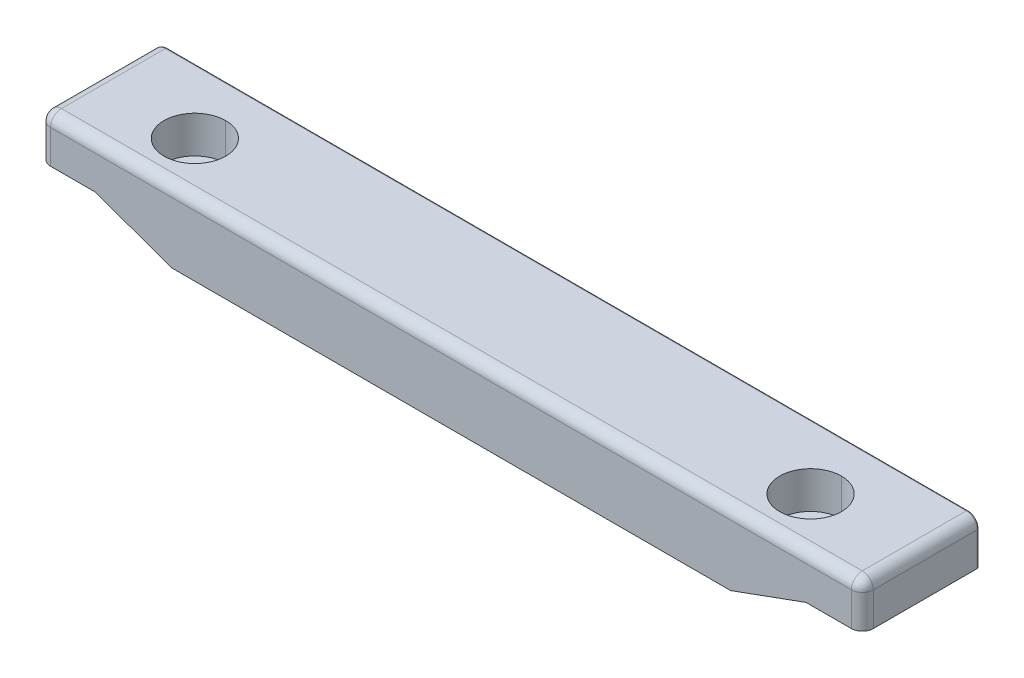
ISO-10303-21;
HEADER;
FILE_DESCRIPTION(('STEP AP214'),'2;1');
FILE_NAME('part.step','',(''),(''),'','','');
FILE_SCHEMA(('AUTOMOTIVE_DESIGN { 1 0 10303 214 1 1 1 1 }'));
ENDSEC;
DATA;
#1=APPLICATION_CONTEXT('core data for automotive mechanical design processes');
#2=APPLICATION_PROTOCOL_DEFINITION('international standard','automotive_design',2000,#1);
#3=PRODUCT_CONTEXT('',#1,'mechanical');
#4=PRODUCT('Part','Part','',(#3));
#5=PRODUCT_RELATED_PRODUCT_CATEGORY('part','',(#4));
#6=PRODUCT_DEFINITION_FORMATION('','',#4);
#7=PRODUCT_DEFINITION_CONTEXT('part definition',#1,'design');
#8=PRODUCT_DEFINITION('design','',#6,#7);
#9=PRODUCT_DEFINITION_SHAPE('','',#8);
#10=(LENGTH_UNIT() NAMED_UNIT(*) SI_UNIT(.MILLI.,.METRE.));
#11=(NAMED_UNIT(*) PLANE_ANGLE_UNIT() SI_UNIT($,.RADIAN.));
#12=(NAMED_UNIT(*) SI_UNIT($,.STERADIAN.) SOLID_ANGLE_UNIT());
#13=UNCERTAINTY_MEASURE_WITH_UNIT(LENGTH_MEASURE(1.E-05),#10,'distance_accuracy_value','');
#14=(GEOMETRIC_REPRESENTATION_CONTEXT(3) GLOBAL_UNCERTAINTY_ASSIGNED_CONTEXT((#13)) GLOBAL_UNIT_ASSIGNED_CONTEXT((#10,
#11,#12)) REPRESENTATION_CONTEXT('',''));
#15=CARTESIAN_POINT('',(0.,0.,0.));
#16=DIRECTION('',(0.,0.,1.));
#17=DIRECTION('',(1.,0.,0.));
#18=AXIS2_PLACEMENT_3D('',#15,#16,#17);
#19=CARTESIAN_POINT('',(-44.9,29.,0.975));
#20=DIRECTION('',(0.,1.,0.));
#21=DIRECTION('',(0.,0.,1.));
#22=AXIS2_PLACEMENT_3D('',#19,#20,#21);
#23=CYLINDRICAL_SURFACE('',#22,4.5);
#24=DIRECTION('',(0.,1.,0.));
#25=VECTOR('',#24,1.);
#26=CARTESIAN_POINT('',(-44.9,29.,-3.525));
#27=LINE('',#26,#25);
#28=CARTESIAN_POINT('',(-44.9,23.6,-3.525));
#29=VERTEX_POINT('',#28);
#30=CARTESIAN_POINT('',(-44.9,29.,-3.525));
#31=VERTEX_POINT('',#30);
#32=EDGE_CURVE('E277',#29,#31,#27,.T.);
#33=ORIENTED_EDGE('',*,*,#32,.F.);
#34=CARTESIAN_POINT('',(-44.9,23.6,0.975));
#35=DIRECTION('',(0.,1.,0.));
#36=DIRECTION('',(0.,0.,1.));
#37=AXIS2_PLACEMENT_3D('',#34,#35,#36);
#38=CIRCLE('',#37,4.5);
#39=CARTESIAN_POINT('',(-44.9,23.6,5.475));
#40=VERTEX_POINT('',#39);
#41=EDGE_CURVE('E10',#40,#29,#38,.T.);
#42=ORIENTED_EDGE('',*,*,#41,.F.);
#43=DIRECTION('',(0.,1.,0.));
#44=VECTOR('',#43,1.);
#45=CARTESIAN_POINT('',(-44.9,29.,5.475));
#46=LINE('',#45,#44);
#47=CARTESIAN_POINT('',(-44.9,29.,5.475));
#48=VERTEX_POINT('',#47);
#49=EDGE_CURVE('E306',#40,#48,#46,.T.);
#50=ORIENTED_EDGE('',*,*,#49,.T.);
#51=CARTESIAN_POINT('',(-44.9,29.,0.975));
#52=DIRECTION('',(0.,1.,0.));
#53=DIRECTION('',(0.,0.,1.));
#54=AXIS2_PLACEMENT_3D('',#51,#52,#53);
#55=CIRCLE('',#54,4.5);
#56=EDGE_CURVE('E396',#48,#31,#55,.T.);
#57=ORIENTED_EDGE('',*,*,#56,.T.);
#58=EDGE_LOOP('',(#33,#42,#50,#57));
#59=FACE_BOUND('',#58,.T.);
#60=ADVANCED_FACE('F15',(#59),#23,.F.);
#61=CARTESIAN_POINT('',(-42.15,23.6,0.975));
#62=DIRECTION('',(0.,-1.,0.));
#63=DIRECTION('',(0.,0.,-1.));
#64=AXIS2_PLACEMENT_3D('',#61,#62,#63);
#65=PLANE('',#64);
#66=CARTESIAN_POINT('',(-44.9,23.6,0.975));
#67=DIRECTION('',(0.,1.,0.));
#68=DIRECTION('',(0.,0.,1.));
#69=AXIS2_PLACEMENT_3D('',#66,#67,#68);
#70=CIRCLE('',#69,2.75);
#71=CARTESIAN_POINT('',(-44.9,23.6,3.725));
#72=VERTEX_POINT('',#71);
#73=CARTESIAN_POINT('',(-44.9,23.6,-1.775));
#74=VERTEX_POINT('',#73);
#75=EDGE_CURVE('E24',#72,#74,#70,.T.);
#76=ORIENTED_EDGE('',*,*,#75,.F.);
#77=CARTESIAN_POINT('',(-44.9,23.6,0.975));
#78=DIRECTION('',(0.,1.,0.));
#79=DIRECTION('',(0.,0.,1.));
#80=AXIS2_PLACEMENT_3D('',#77,#78,#79);
#81=CIRCLE('',#80,2.75);
#82=EDGE_CURVE('E338',#74,#72,#81,.T.);
#83=ORIENTED_EDGE('',*,*,#82,.F.);
#84=EDGE_LOOP('',(#76,#83));
#85=FACE_BOUND('',#84,.T.);
#86=ORIENTED_EDGE('',*,*,#41,.T.);
#87=CARTESIAN_POINT('',(-44.9,23.6,0.975));
#88=DIRECTION('',(0.,1.,0.));
#89=DIRECTION('',(0.,0.,1.));
#90=AXIS2_PLACEMENT_3D('',#87,#88,#89);
#91=CIRCLE('',#90,4.5);
#92=EDGE_CURVE('E274',#29,#40,#91,.T.);
#93=ORIENTED_EDGE('',*,*,#92,.T.);
#94=EDGE_LOOP('',(#86,#93));
#95=FACE_BOUND('',#94,.T.);
#96=ADVANCED_FACE('F597',(#85,#95),#65,.F.);
#97=CARTESIAN_POINT('',(-44.9,29.,0.975));
#98=DIRECTION('',(0.,1.,0.));
#99=DIRECTION('',(0.,0.,1.));
#100=AXIS2_PLACEMENT_3D('',#97,#98,#99);
#101=CYLINDRICAL_SURFACE('',#100,2.75);
#102=DIRECTION('',(0.,1.,0.));
#103=VECTOR('',#102,1.);
#104=CARTESIAN_POINT('',(-44.9,29.,-1.775));
#105=LINE('',#104,#103);
#106=CARTESIAN_POINT('',(-44.9,19.9975988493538,-1.775));
#107=VERTEX_POINT('',#106);
#108=EDGE_CURVE('E332',#107,#74,#105,.T.);
#109=ORIENTED_EDGE('',*,*,#108,.F.);
#110=CARTESIAN_POINT('',(-44.9,19.9975988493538,3.725));
#111=CARTESIAN_POINT('',(-39.3999999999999,17.9957625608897,3.725));
#112=CARTESIAN_POINT('',(-39.3999999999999,17.9957625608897,-1.77499999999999));
#113=CARTESIAN_POINT('',(-44.9,19.9975988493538,-1.775));
#114=(BOUNDED_CURVE() B_SPLINE_CURVE(3,(#110,#111,#112,#113),.UNSPECIFIED.,.F.,
.F.) B_SPLINE_CURVE_WITH_KNOTS((4,4),(1.5707963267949,4.71238898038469),
.UNSPECIFIED.) CURVE() GEOMETRIC_REPRESENTATION_ITEM() RATIONAL_B_SPLINE_CURVE((1.,
0.333333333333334,0.333333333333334,1.)) REPRESENTATION_ITEM(''));
#115=CARTESIAN_POINT('',(-44.9,19.9975988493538,3.725));
#116=VERTEX_POINT('',#115);
#117=EDGE_CURVE('E420',#116,#107,#114,.T.);
#118=ORIENTED_EDGE('',*,*,#117,.F.);
#119=DIRECTION('',(0.,1.,0.));
#120=VECTOR('',#119,1.);
#121=CARTESIAN_POINT('',(-44.9,29.,3.725));
#122=LINE('',#121,#120);
#123=EDGE_CURVE('E349',#116,#72,#122,.T.);
#124=ORIENTED_EDGE('',*,*,#123,.T.);
#125=ORIENTED_EDGE('',*,*,#75,.T.);
#126=EDGE_LOOP('',(#109,#118,#124,#125));
#127=FACE_BOUND('',#126,.T.);
#128=ADVANCED_FACE('F602',(#127),#101,.F.);
#129=CARTESIAN_POINT('',(44.9,29.,0.974999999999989));
#130=DIRECTION('',(0.,1.,0.));
#131=DIRECTION('',(0.,0.,1.));
#132=AXIS2_PLACEMENT_3D('',#129,#130,#131);
#133=CYLINDRICAL_SURFACE('',#132,4.5);
#134=DIRECTION('',(0.,1.,0.));
#135=VECTOR('',#134,1.);
#136=CARTESIAN_POINT('',(44.9,29.,-3.525));
#137=LINE('',#136,#135);
#138=CARTESIAN_POINT('',(44.9,23.6,-3.525));
#139=VERTEX_POINT('',#138);
#140=CARTESIAN_POINT('',(44.9,29.,-3.525));
#141=VERTEX_POINT('',#140);
#142=EDGE_CURVE('E288',#139,#141,#137,.T.);
#143=ORIENTED_EDGE('',*,*,#142,.F.);
#144=CARTESIAN_POINT('',(44.9,23.6,0.974999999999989));
#145=DIRECTION('',(0.,1.,0.));
#146=DIRECTION('',(0.,0.,1.));
#147=AXIS2_PLACEMENT_3D('',#144,#145,#146);
#148=CIRCLE('',#147,4.5);
#149=CARTESIAN_POINT('',(44.9,23.6,5.475));
#150=VERTEX_POINT('',#149);
#151=EDGE_CURVE('E448',#150,#139,#148,.T.);
#152=ORIENTED_EDGE('',*,*,#151,.F.);
#153=DIRECTION('',(0.,1.,0.));
#154=VECTOR('',#153,1.);
#155=CARTESIAN_POINT('',(44.9,29.,5.475));
#156=LINE('',#155,#154);
#157=CARTESIAN_POINT('',(44.9,29.,5.475));
#158=VERTEX_POINT('',#157);
#159=EDGE_CURVE('E313',#150,#158,#156,.T.);
#160=ORIENTED_EDGE('',*,*,#159,.T.);
#161=CARTESIAN_POINT('',(44.9,29.,0.974999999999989));
#162=DIRECTION('',(0.,1.,0.));
#163=DIRECTION('',(0.,0.,1.));
#164=AXIS2_PLACEMENT_3D('',#161,#162,#163);
#165=CIRCLE('',#164,4.5);
#166=EDGE_CURVE('E399',#158,#141,#165,.T.);
#167=ORIENTED_EDGE('',*,*,#166,.T.);
#168=EDGE_LOOP('',(#143,#152,#160,#167));
#169=FACE_BOUND('',#168,.T.);
#170=ADVANCED_FACE('F647',(#169),#133,.F.);
#171=CARTESIAN_POINT('',(47.65,23.6,0.974999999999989));
#172=DIRECTION('',(0.,-1.,0.));
#173=DIRECTION('',(0.,0.,-1.));
#174=AXIS2_PLACEMENT_3D('',#171,#172,#173);
#175=PLANE('',#174);
#176=CARTESIAN_POINT('',(44.9,23.6,0.974999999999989));
#177=DIRECTION('',(0.,1.,0.));
#178=DIRECTION('',(0.,0.,1.));
#179=AXIS2_PLACEMENT_3D('',#176,#177,#178);
#180=CIRCLE('',#179,2.75);
#181=CARTESIAN_POINT('',(44.9,23.6,3.725));
#182=VERTEX_POINT('',#181);
#183=CARTESIAN_POINT('',(44.9,23.6,-1.775));
#184=VERTEX_POINT('',#183);
#185=EDGE_CURVE('E18',#182,#184,#180,.T.);
#186=ORIENTED_EDGE('',*,*,#185,.F.);
#187=CARTESIAN_POINT('',(44.9,23.6,0.974999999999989));
#188=DIRECTION('',(0.,1.,0.));
#189=DIRECTION('',(0.,0.,1.));
#190=AXIS2_PLACEMENT_3D('',#187,#188,#189);
#191=CIRCLE('',#190,2.75);
#192=EDGE_CURVE('E343',#184,#182,#191,.T.);
#193=ORIENTED_EDGE('',*,*,#192,.F.);
#194=EDGE_LOOP('',(#186,#193));
#195=FACE_BOUND('',#194,.T.);
#196=ORIENTED_EDGE('',*,*,#151,.T.);
#197=CARTESIAN_POINT('',(44.9,23.6,0.974999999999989));
#198=DIRECTION('',(0.,1.,0.));
#199=DIRECTION('',(0.,0.,1.));
#200=AXIS2_PLACEMENT_3D('',#197,#198,#199);
#201=CIRCLE('',#200,4.5);
#202=EDGE_CURVE('E293',#139,#150,#201,.T.);
#203=ORIENTED_EDGE('',*,*,#202,.T.);
#204=EDGE_LOOP('',(#196,#203));
#205=FACE_BOUND('',#204,.T.);
#206=ADVANCED_FACE('F530',(#195,#205),#175,.F.);
#207=CARTESIAN_POINT('',(44.9,29.,0.974999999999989));
#208=DIRECTION('',(0.,1.,0.));
#209=DIRECTION('',(0.,0.,1.));
#210=AXIS2_PLACEMENT_3D('',#207,#208,#209);
#211=CYLINDRICAL_SURFACE('',#210,2.75);
#212=DIRECTION('',(0.,1.,0.));
#213=VECTOR('',#212,1.);
#214=CARTESIAN_POINT('',(44.9,29.,-1.775));
#215=LINE('',#214,#213);
#216=CARTESIAN_POINT('',(44.9,19.9975988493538,-1.775));
#217=VERTEX_POINT('',#216);
#218=EDGE_CURVE('E340',#217,#184,#215,.T.);
#219=ORIENTED_EDGE('',*,*,#218,.F.);
#220=CARTESIAN_POINT('',(44.9,19.9975988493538,3.725));
#221=CARTESIAN_POINT('',(50.4,21.9994351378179,3.72499999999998));
#222=CARTESIAN_POINT('',(50.4,21.9994351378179,-1.77500000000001));
#223=CARTESIAN_POINT('',(44.9,19.9975988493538,-1.775));
#224=(BOUNDED_CURVE() B_SPLINE_CURVE(3,(#220,#221,#222,#223),.UNSPECIFIED.,.F.,
.F.) B_SPLINE_CURVE_WITH_KNOTS((4,4),(4.71238898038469,7.85398163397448),
.UNSPECIFIED.) CURVE() GEOMETRIC_REPRESENTATION_ITEM() RATIONAL_B_SPLINE_CURVE((1.,
0.333333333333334,0.333333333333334,1.)) REPRESENTATION_ITEM(''));
#225=CARTESIAN_POINT('',(44.9,19.9975988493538,3.725));
#226=VERTEX_POINT('',#225);
#227=EDGE_CURVE('E419',#226,#217,#224,.T.);
#228=ORIENTED_EDGE('',*,*,#227,.F.);
#229=DIRECTION('',(0.,1.,0.));
#230=VECTOR('',#229,1.);
#231=CARTESIAN_POINT('',(44.9,29.,3.725));
#232=LINE('',#231,#230);
#233=EDGE_CURVE('E359',#226,#182,#232,.T.);
#234=ORIENTED_EDGE('',*,*,#233,.T.);
#235=ORIENTED_EDGE('',*,*,#185,.T.);
#236=EDGE_LOOP('',(#219,#228,#234,#235));
#237=FACE_BOUND('',#236,.T.);
#238=ADVANCED_FACE('F526',(#237),#211,.F.);
#239=CARTESIAN_POINT('',(51.7882898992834,22.5047313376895,-128.591982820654));
#240=DIRECTION('',(-0.342020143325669,0.939692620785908,0.));
#241=DIRECTION('',(0.,0.,1.));
#242=AXIS2_PLACEMENT_3D('',#239,#240,#241);
#243=PLANE('',#242);
#244=ORIENTED_EDGE('',*,*,#227,.T.);
#245=CARTESIAN_POINT('',(44.9,19.9975988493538,-1.775));
#246=CARTESIAN_POINT('',(39.4,17.9957625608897,-1.77500000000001));
#247=CARTESIAN_POINT('',(39.4,17.9957625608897,3.72499999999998));
#248=CARTESIAN_POINT('',(44.9,19.9975988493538,3.725));
#249=(BOUNDED_CURVE() B_SPLINE_CURVE(3,(#245,#246,#247,#248),.UNSPECIFIED.,.F.,
.F.) B_SPLINE_CURVE_WITH_KNOTS((4,4),(1.5707963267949,4.71238898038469),
.UNSPECIFIED.) CURVE() GEOMETRIC_REPRESENTATION_ITEM() RATIONAL_B_SPLINE_CURVE((1.,
0.333333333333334,0.333333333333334,1.)) REPRESENTATION_ITEM(''));
#250=EDGE_CURVE('E344',#217,#226,#249,.T.);
#251=ORIENTED_EDGE('',*,*,#250,.T.);
#252=EDGE_LOOP('',(#244,#251));
#253=FACE_BOUND('',#252,.T.);
#254=DIRECTION('',(0.939692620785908,0.342020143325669,0.));
#255=VECTOR('',#254,1.);
#256=CARTESIAN_POINT('',(51.7882898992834,22.5047313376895,-8.525));
#257=LINE('',#256,#255);
#258=CARTESIAN_POINT('',(40.7991183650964,18.505,-8.525));
#259=VERTEX_POINT('',#258);
#260=CARTESIAN_POINT('',(51.7891183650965,22.5050328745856,-8.525));
#261=VERTEX_POINT('',#260);
#262=EDGE_CURVE('E462',#259,#261,#257,.T.);
#263=ORIENTED_EDGE('',*,*,#262,.T.);
#264=DIRECTION('',(0.,0.,1.));
#265=VECTOR('',#264,1.);
#266=CARTESIAN_POINT('',(51.7891183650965,22.5050328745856,-128.591982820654));
#267=LINE('',#266,#265);
#268=CARTESIAN_POINT('',(51.7891183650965,22.5050328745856,8.525));
#269=VERTEX_POINT('',#268);
#270=EDGE_CURVE('E498',#261,#269,#267,.T.);
#271=ORIENTED_EDGE('',*,*,#270,.T.);
#272=DIRECTION('',(-0.939692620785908,-0.342020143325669,0.));
#273=VECTOR('',#272,1.);
#274=CARTESIAN_POINT('',(51.7882898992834,22.5047313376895,8.525));
#275=LINE('',#274,#273);
#276=CARTESIAN_POINT('',(40.7991183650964,18.505,8.525));
#277=VERTEX_POINT('',#276);
#278=EDGE_CURVE('E298',#269,#277,#275,.T.);
#279=ORIENTED_EDGE('',*,*,#278,.T.);
#280=DIRECTION('',(0.,0.,1.));
#281=VECTOR('',#280,1.);
#282=CARTESIAN_POINT('',(40.7991183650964,18.505,-128.591982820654));
#283=LINE('',#282,#281);
#284=EDGE_CURVE('E36',#259,#277,#283,.T.);
#285=ORIENTED_EDGE('',*,*,#284,.F.);
#286=EDGE_LOOP('',(#263,#271,#279,#285));
#287=FACE_BOUND('',#286,.T.);
#288=ADVANCED_FACE('F534',(#253,#287),#243,.F.);
#289=CARTESIAN_POINT('',(-40.8,18.505,-128.591982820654));
#290=DIRECTION('',(0.,1.,0.));
#291=DIRECTION('',(1.,0.,0.));
#292=AXIS2_PLACEMENT_3D('',#289,#290,#291);
#293=PLANE('',#292);
#294=DIRECTION('',(1.,0.,0.));
#295=VECTOR('',#294,1.);
#296=CARTESIAN_POINT('',(-40.8,18.505,-8.525));
#297=LINE('',#296,#295);
#298=CARTESIAN_POINT('',(-40.7991183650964,18.505,-8.525));
#299=VERTEX_POINT('',#298);
#300=EDGE_CURVE('E466',#299,#259,#297,.T.);
#301=ORIENTED_EDGE('',*,*,#300,.T.);
#302=ORIENTED_EDGE('',*,*,#284,.T.);
#303=DIRECTION('',(-1.,0.,0.));
#304=VECTOR('',#303,1.);
#305=CARTESIAN_POINT('',(-40.8,18.505,8.525));
#306=LINE('',#305,#304);
#307=CARTESIAN_POINT('',(-40.7991183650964,18.505,8.525));
#308=VERTEX_POINT('',#307);
#309=EDGE_CURVE('E325',#277,#308,#306,.T.);
#310=ORIENTED_EDGE('',*,*,#309,.T.);
#311=DIRECTION('',(0.,0.,1.));
#312=VECTOR('',#311,1.);
#313=CARTESIAN_POINT('',(-40.7991183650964,18.505,-128.591982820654));
#314=LINE('',#313,#312);
#315=EDGE_CURVE('E46',#299,#308,#314,.T.);
#316=ORIENTED_EDGE('',*,*,#315,.F.);
#317=EDGE_LOOP('',(#301,#302,#310,#316));
#318=FACE_BOUND('',#317,.T.);
#319=ADVANCED_FACE('F537',(#318),#293,.F.);
#320=CARTESIAN_POINT('',(-51.7882898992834,22.5047313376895,-128.591982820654));
#321=DIRECTION('',(0.342020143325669,0.939692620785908,0.));
#322=DIRECTION('',(0.,0.,-1.));
#323=AXIS2_PLACEMENT_3D('',#320,#321,#322);
#324=PLANE('',#323);
#325=ORIENTED_EDGE('',*,*,#117,.T.);
#326=CARTESIAN_POINT('',(-44.9,19.9975988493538,-1.775));
#327=CARTESIAN_POINT('',(-50.4,21.9994351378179,-1.775));
#328=CARTESIAN_POINT('',(-50.4,21.9994351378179,3.72499999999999));
#329=CARTESIAN_POINT('',(-44.9,19.9975988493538,3.725));
#330=(BOUNDED_CURVE() B_SPLINE_CURVE(3,(#326,#327,#328,#329),.UNSPECIFIED.,.F.,
.F.) B_SPLINE_CURVE_WITH_KNOTS((4,4),(4.71238898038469,7.85398163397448),
.UNSPECIFIED.) CURVE() GEOMETRIC_REPRESENTATION_ITEM() RATIONAL_B_SPLINE_CURVE((1.,
0.333333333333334,0.333333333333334,1.)) REPRESENTATION_ITEM(''));
#331=EDGE_CURVE('E321',#107,#116,#330,.T.);
#332=ORIENTED_EDGE('',*,*,#331,.T.);
#333=EDGE_LOOP('',(#325,#332));
#334=FACE_BOUND('',#333,.T.);
#335=DIRECTION('',(0.939692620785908,-0.342020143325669,0.));
#336=VECTOR('',#335,1.);
#337=CARTESIAN_POINT('',(-51.7882898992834,22.5047313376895,-8.525));
#338=LINE('',#337,#336);
#339=CARTESIAN_POINT('',(-51.7891183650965,22.5050328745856,-8.525));
#340=VERTEX_POINT('',#339);
#341=EDGE_CURVE('E469',#340,#299,#338,.T.);
#342=ORIENTED_EDGE('',*,*,#341,.T.);
#343=ORIENTED_EDGE('',*,*,#315,.T.);
#344=DIRECTION('',(-0.939692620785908,0.342020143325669,0.));
#345=VECTOR('',#344,1.);
#346=CARTESIAN_POINT('',(-51.7882898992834,22.5047313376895,8.525));
#347=LINE('',#346,#345);
#348=CARTESIAN_POINT('',(-51.7891183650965,22.5050328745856,8.525));
#349=VERTEX_POINT('',#348);
#350=EDGE_CURVE('E322',#308,#349,#347,.T.);
#351=ORIENTED_EDGE('',*,*,#350,.T.);
#352=DIRECTION('',(0.,0.,1.));
#353=VECTOR('',#352,1.);
#354=CARTESIAN_POINT('',(-51.7891183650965,22.5050328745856,-128.591982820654));
#355=LINE('',#354,#353);
#356=EDGE_CURVE('E501',#340,#349,#355,.T.);
#357=ORIENTED_EDGE('',*,*,#356,.F.);
#358=EDGE_LOOP('',(#342,#343,#351,#357));
#359=FACE_BOUND('',#358,.T.);
#360=ADVANCED_FACE('F585',(#334,#359),#324,.F.);
#361=CARTESIAN_POINT('',(-60.,22.5050328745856,-128.591982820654));
#362=DIRECTION('',(0.,1.,0.));
#363=DIRECTION('',(1.,0.,0.));
#364=AXIS2_PLACEMENT_3D('',#361,#362,#363);
#365=PLANE('',#364);
#366=CARTESIAN_POINT('',(-58.4,22.5050328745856,6.925));
#367=DIRECTION('',(0.,-1.,0.));
#368=DIRECTION('',(0.,0.,1.));
#369=AXIS2_PLACEMENT_3D('',#366,#367,#368);
#370=CIRCLE('',#369,1.6);
#371=CARTESIAN_POINT('',(-58.4,22.5050328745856,8.525));
#372=VERTEX_POINT('',#371);
#373=CARTESIAN_POINT('',(-60.,22.5050328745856,6.925));
#374=VERTEX_POINT('',#373);
#375=EDGE_CURVE('E231',#372,#374,#370,.T.);
#376=ORIENTED_EDGE('',*,*,#375,.T.);
#377=DIRECTION('',(0.,0.,1.));
#378=VECTOR('',#377,1.);
#379=CARTESIAN_POINT('',(-60.,22.5050328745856,-128.591982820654));
#380=LINE('',#379,#378);
#381=CARTESIAN_POINT('',(-60.,22.5050328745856,-8.225));
#382=VERTEX_POINT('',#381);
#383=EDGE_CURVE('E297',#382,#374,#380,.T.);
#384=ORIENTED_EDGE('',*,*,#383,.F.);
#385=CARTESIAN_POINT('',(-59.7,22.5050328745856,-8.225));
#386=DIRECTION('',(0.,-1.,0.));
#387=DIRECTION('',(0.,0.,1.));
#388=AXIS2_PLACEMENT_3D('',#385,#386,#387);
#389=CIRCLE('',#388,0.3);
#390=CARTESIAN_POINT('',(-59.7,22.5050328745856,-8.525));
#391=VERTEX_POINT('',#390);
#392=EDGE_CURVE('E309',#382,#391,#389,.T.);
#393=ORIENTED_EDGE('',*,*,#392,.T.);
#394=DIRECTION('',(1.,0.,0.));
#395=VECTOR('',#394,1.);
#396=CARTESIAN_POINT('',(-60.,22.5050328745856,-8.525));
#397=LINE('',#396,#395);
#398=EDGE_CURVE('E472',#391,#340,#397,.T.);
#399=ORIENTED_EDGE('',*,*,#398,.T.);
#400=ORIENTED_EDGE('',*,*,#356,.T.);
#401=DIRECTION('',(-1.,0.,0.));
#402=VECTOR('',#401,1.);
#403=CARTESIAN_POINT('',(-60.,22.5050328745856,8.525));
#404=LINE('',#403,#402);
#405=EDGE_CURVE('E326',#349,#372,#404,.T.);
#406=ORIENTED_EDGE('',*,*,#405,.T.);
#407=EDGE_LOOP('',(#376,#384,#393,#399,#400,#406));
#408=FACE_BOUND('',#407,.T.);
#409=ADVANCED_FACE('F583',(#408),#365,.F.);
#410=CARTESIAN_POINT('',(60.,22.5050328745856,-128.591982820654));
#411=DIRECTION('',(0.,1.,0.));
#412=DIRECTION('',(1.,0.,0.));
#413=AXIS2_PLACEMENT_3D('',#410,#411,#412);
#414=PLANE('',#413);
#415=CARTESIAN_POINT('',(58.4,22.5050328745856,6.925));
#416=DIRECTION('',(0.,-1.,0.));
#417=DIRECTION('',(0.,0.,1.));
#418=AXIS2_PLACEMENT_3D('',#415,#416,#417);
#419=CIRCLE('',#418,1.6);
#420=CARTESIAN_POINT('',(60.,22.5050328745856,6.925));
#421=VERTEX_POINT('',#420);
#422=CARTESIAN_POINT('',(58.4,22.5050328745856,8.525));
#423=VERTEX_POINT('',#422);
#424=EDGE_CURVE('E480',#421,#423,#419,.T.);
#425=ORIENTED_EDGE('',*,*,#424,.T.);
#426=DIRECTION('',(-1.,0.,0.));
#427=VECTOR('',#426,1.);
#428=CARTESIAN_POINT('',(60.,22.5050328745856,8.525));
#429=LINE('',#428,#427);
#430=EDGE_CURVE('E426',#423,#269,#429,.T.);
#431=ORIENTED_EDGE('',*,*,#430,.T.);
#432=ORIENTED_EDGE('',*,*,#270,.F.);
#433=DIRECTION('',(1.,0.,0.));
#434=VECTOR('',#433,1.);
#435=CARTESIAN_POINT('',(60.,22.5050328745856,-8.525));
#436=LINE('',#435,#434);
#437=CARTESIAN_POINT('',(59.7,22.5050328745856,-8.525));
#438=VERTEX_POINT('',#437);
#439=EDGE_CURVE('E457',#261,#438,#436,.T.);
#440=ORIENTED_EDGE('',*,*,#439,.T.);
#441=CARTESIAN_POINT('',(59.7,22.5050328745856,-8.225));
#442=DIRECTION('',(0.,-1.,0.));
#443=DIRECTION('',(0.,0.,1.));
#444=AXIS2_PLACEMENT_3D('',#441,#442,#443);
#445=CIRCLE('',#444,0.3);
#446=CARTESIAN_POINT('',(60.,22.5050328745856,-8.225));
#447=VERTEX_POINT('',#446);
#448=EDGE_CURVE('E350',#438,#447,#445,.T.);
#449=ORIENTED_EDGE('',*,*,#448,.T.);
#450=DIRECTION('',(0.,0.,1.));
#451=VECTOR('',#450,1.);
#452=CARTESIAN_POINT('',(60.,22.5050328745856,-128.591982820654));
#453=LINE('',#452,#451);
#454=EDGE_CURVE('E294',#447,#421,#453,.T.);
#455=ORIENTED_EDGE('',*,*,#454,.T.);
#456=EDGE_LOOP('',(#425,#431,#432,#440,#449,#455));
#457=FACE_BOUND('',#456,.T.);
#458=ADVANCED_FACE('F547',(#457),#414,.F.);
#459=CARTESIAN_POINT('',(-60.,29.,8.525));
#460=DIRECTION('',(1.,0.,0.));
#461=DIRECTION('',(0.,1.,0.));
#462=AXIS2_PLACEMENT_3D('',#459,#460,#461);
#463=PLANE('',#462);
#464=DIRECTION('',(0.,-1.,0.));
#465=VECTOR('',#464,1.);
#466=CARTESIAN_POINT('',(-60.,29.,-8.225));
#467=LINE('',#466,#465);
#468=CARTESIAN_POINT('',(-60.,27.4,-8.225));
#469=VERTEX_POINT('',#468);
#470=EDGE_CURVE('E442',#469,#382,#467,.T.);
#471=ORIENTED_EDGE('',*,*,#470,.T.);
#472=ORIENTED_EDGE('',*,*,#383,.T.);
#473=DIRECTION('',(0.,1.,0.));
#474=VECTOR('',#473,1.);
#475=CARTESIAN_POINT('',(-60.,29.,6.925));
#476=LINE('',#475,#474);
#477=CARTESIAN_POINT('',(-60.,27.4,6.925));
#478=VERTEX_POINT('',#477);
#479=EDGE_CURVE('E236',#374,#478,#476,.T.);
#480=ORIENTED_EDGE('',*,*,#479,.T.);
#481=DIRECTION('',(0.,0.,-1.));
#482=VECTOR('',#481,1.);
#483=CARTESIAN_POINT('',(-60.,27.4,8.525));
#484=LINE('',#483,#482);
#485=EDGE_CURVE('E405',#478,#469,#484,.T.);
#486=ORIENTED_EDGE('',*,*,#485,.T.);
#487=EDGE_LOOP('',(#471,#472,#480,#486));
#488=FACE_BOUND('',#487,.T.);
#489=ADVANCED_FACE('F580',(#488),#463,.F.);
#490=CARTESIAN_POINT('',(60.,29.,8.525));
#491=DIRECTION('',(-1.,0.,0.));
#492=DIRECTION('',(0.,0.,1.));
#493=AXIS2_PLACEMENT_3D('',#490,#491,#492);
#494=PLANE('',#493);
#495=DIRECTION('',(0.,-1.,0.));
#496=VECTOR('',#495,1.);
#497=CARTESIAN_POINT('',(60.,-29.,6.925));
#498=LINE('',#497,#496);
#499=CARTESIAN_POINT('',(60.,27.4,6.925));
#500=VERTEX_POINT('',#499);
#501=EDGE_CURVE('E427',#500,#421,#498,.T.);
#502=ORIENTED_EDGE('',*,*,#501,.T.);
#503=ORIENTED_EDGE('',*,*,#454,.F.);
#504=DIRECTION('',(0.,1.,0.));
#505=VECTOR('',#504,1.);
#506=CARTESIAN_POINT('',(60.,29.,-8.225));
#507=LINE('',#506,#505);
#508=CARTESIAN_POINT('',(60.,27.4,-8.225));
#509=VERTEX_POINT('',#508);
#510=EDGE_CURVE('E454',#447,#509,#507,.T.);
#511=ORIENTED_EDGE('',*,*,#510,.T.);
#512=DIRECTION('',(0.,0.,1.));
#513=VECTOR('',#512,1.);
#514=CARTESIAN_POINT('',(60.,27.4,8.525));
#515=LINE('',#514,#513);
#516=EDGE_CURVE('E412',#509,#500,#515,.T.);
#517=ORIENTED_EDGE('',*,*,#516,.T.);
#518=EDGE_LOOP('',(#502,#503,#511,#517));
#519=FACE_BOUND('',#518,.T.);
#520=ADVANCED_FACE('F561',(#519),#494,.F.);
#521=CARTESIAN_POINT('',(0.,0.,8.525));
#522=DIRECTION('',(0.,0.,1.));
#523=DIRECTION('',(1.,0.,0.));
#524=AXIS2_PLACEMENT_3D('',#521,#522,#523);
#525=PLANE('',#524);
#526=ORIENTED_EDGE('',*,*,#430,.F.);
#527=DIRECTION('',(0.,1.,0.));
#528=VECTOR('',#527,1.);
#529=CARTESIAN_POINT('',(58.4,29.,8.525));
#530=LINE('',#529,#528);
#531=CARTESIAN_POINT('',(58.4,27.4,8.525));
#532=VERTEX_POINT('',#531);
#533=EDGE_CURVE('E253',#423,#532,#530,.T.);
#534=ORIENTED_EDGE('',*,*,#533,.T.);
#535=DIRECTION('',(-1.,0.,0.));
#536=VECTOR('',#535,1.);
#537=CARTESIAN_POINT('',(-60.,27.4,8.525));
#538=LINE('',#537,#536);
#539=CARTESIAN_POINT('',(-58.4,27.4,8.525));
#540=VERTEX_POINT('',#539);
#541=EDGE_CURVE('E250',#532,#540,#538,.T.);
#542=ORIENTED_EDGE('',*,*,#541,.T.);
#543=DIRECTION('',(0.,-1.,0.));
#544=VECTOR('',#543,1.);
#545=CARTESIAN_POINT('',(-58.4,-29.,8.525));
#546=LINE('',#545,#544);
#547=EDGE_CURVE('E224',#540,#372,#546,.T.);
#548=ORIENTED_EDGE('',*,*,#547,.T.);
#549=ORIENTED_EDGE('',*,*,#405,.F.);
#550=ORIENTED_EDGE('',*,*,#350,.F.);
#551=ORIENTED_EDGE('',*,*,#309,.F.);
#552=ORIENTED_EDGE('',*,*,#278,.F.);
#553=EDGE_LOOP('',(#526,#534,#542,#548,#549,#550,#551,#552));
#554=FACE_BOUND('',#553,.T.);
#555=ADVANCED_FACE('F251',(#554),#525,.T.);
#556=CARTESIAN_POINT('',(58.4,0.,6.925));
#557=DIRECTION('',(0.,-1.,0.));
#558=DIRECTION('',(0.,0.,-1.));
#559=AXIS2_PLACEMENT_3D('',#556,#557,#558);
#560=CYLINDRICAL_SURFACE('',#559,1.6);
#561=ORIENTED_EDGE('',*,*,#424,.F.);
#562=ORIENTED_EDGE('',*,*,#501,.F.);
#563=CARTESIAN_POINT('',(58.4,27.4,6.925));
#564=DIRECTION('',(0.,-1.,0.));
#565=DIRECTION('',(0.,0.,1.));
#566=AXIS2_PLACEMENT_3D('',#563,#564,#565);
#567=CIRCLE('',#566,1.6);
#568=EDGE_CURVE('E247',#500,#532,#567,.T.);
#569=ORIENTED_EDGE('',*,*,#568,.T.);
#570=ORIENTED_EDGE('',*,*,#533,.F.);
#571=EDGE_LOOP('',(#561,#562,#569,#570));
#572=FACE_BOUND('',#571,.T.);
#573=ADVANCED_FACE('F551',(#572),#560,.T.);
#574=CARTESIAN_POINT('',(-58.4,0.,6.925));
#575=DIRECTION('',(0.,1.,0.));
#576=DIRECTION('',(-1.,0.,0.));
#577=AXIS2_PLACEMENT_3D('',#574,#575,#576);
#578=CYLINDRICAL_SURFACE('',#577,1.6);
#579=ORIENTED_EDGE('',*,*,#375,.F.);
#580=ORIENTED_EDGE('',*,*,#547,.F.);
#581=CARTESIAN_POINT('',(-58.4,27.4,6.925));
#582=DIRECTION('',(0.,-1.,0.));
#583=DIRECTION('',(0.,0.,1.));
#584=AXIS2_PLACEMENT_3D('',#581,#582,#583);
#585=CIRCLE('',#584,1.6);
#586=EDGE_CURVE('E228',#540,#478,#585,.T.);
#587=ORIENTED_EDGE('',*,*,#586,.T.);
#588=ORIENTED_EDGE('',*,*,#479,.F.);
#589=EDGE_LOOP('',(#579,#580,#587,#588));
#590=FACE_BOUND('',#589,.T.);
#591=ADVANCED_FACE('F226',(#590),#578,.T.);
#592=CARTESIAN_POINT('',(0.,0.,-8.525));
#593=DIRECTION('',(0.,0.,1.));
#594=DIRECTION('',(1.,0.,0.));
#595=AXIS2_PLACEMENT_3D('',#592,#593,#594);
#596=PLANE('',#595);
#597=DIRECTION('',(0.,-1.,0.));
#598=VECTOR('',#597,1.);
#599=CARTESIAN_POINT('',(59.7,0.,-8.525));
#600=LINE('',#599,#598);
#601=CARTESIAN_POINT('',(59.7,27.4,-8.525));
#602=VERTEX_POINT('',#601);
#603=EDGE_CURVE('E354',#602,#438,#600,.T.);
#604=ORIENTED_EDGE('',*,*,#603,.T.);
#605=ORIENTED_EDGE('',*,*,#439,.F.);
#606=ORIENTED_EDGE('',*,*,#262,.F.);
#607=ORIENTED_EDGE('',*,*,#300,.F.);
#608=ORIENTED_EDGE('',*,*,#341,.F.);
#609=ORIENTED_EDGE('',*,*,#398,.F.);
#610=DIRECTION('',(0.,1.,0.));
#611=VECTOR('',#610,1.);
#612=CARTESIAN_POINT('',(-59.7,0.,-8.525));
#613=LINE('',#612,#611);
#614=CARTESIAN_POINT('',(-59.7,27.4,-8.525));
#615=VERTEX_POINT('',#614);
#616=EDGE_CURVE('E355',#391,#615,#613,.T.);
#617=ORIENTED_EDGE('',*,*,#616,.T.);
#618=CARTESIAN_POINT('',(-58.4,27.4,-8.525));
#619=DIRECTION('',(0.,0.,-1.));
#620=DIRECTION('',(1.,0.,0.));
#621=AXIS2_PLACEMENT_3D('',#618,#619,#620);
#622=CIRCLE('',#621,1.3);
#623=CARTESIAN_POINT('',(-58.4,28.7,-8.525));
#624=VERTEX_POINT('',#623);
#625=EDGE_CURVE('E286',#615,#624,#622,.T.);
#626=ORIENTED_EDGE('',*,*,#625,.T.);
#627=DIRECTION('',(1.,0.,0.));
#628=VECTOR('',#627,1.);
#629=CARTESIAN_POINT('',(0.,28.7,-8.525));
#630=LINE('',#629,#628);
#631=CARTESIAN_POINT('',(58.4,28.7,-8.525));
#632=VERTEX_POINT('',#631);
#633=EDGE_CURVE('E302',#624,#632,#630,.T.);
#634=ORIENTED_EDGE('',*,*,#633,.T.);
#635=CARTESIAN_POINT('',(58.4,27.4,-8.525));
#636=DIRECTION('',(0.,0.,-1.));
#637=DIRECTION('',(1.,0.,0.));
#638=AXIS2_PLACEMENT_3D('',#635,#636,#637);
#639=CIRCLE('',#638,1.3);
#640=EDGE_CURVE('E287',#632,#602,#639,.T.);
#641=ORIENTED_EDGE('',*,*,#640,.T.);
#642=EDGE_LOOP('',(#604,#605,#606,#607,#608,#609,#617,#626,#634,#641));
#643=FACE_BOUND('',#642,.T.);
#644=ADVANCED_FACE('F544',(#643),#596,.F.);
#645=CARTESIAN_POINT('',(59.7,29.,-8.225));
#646=DIRECTION('',(0.,1.,0.));
#647=DIRECTION('',(0.,0.,1.));
#648=AXIS2_PLACEMENT_3D('',#645,#646,#647);
#649=CYLINDRICAL_SURFACE('',#648,0.3);
#650=ORIENTED_EDGE('',*,*,#448,.F.);
#651=ORIENTED_EDGE('',*,*,#603,.F.);
#652=CARTESIAN_POINT('',(59.7,27.4,-8.225));
#653=DIRECTION('',(0.,1.,0.));
#654=DIRECTION('',(0.,0.,1.));
#655=AXIS2_PLACEMENT_3D('',#652,#653,#654);
#656=CIRCLE('',#655,0.3);
#657=EDGE_CURVE('E246',#509,#602,#656,.T.);
#658=ORIENTED_EDGE('',*,*,#657,.F.);
#659=ORIENTED_EDGE('',*,*,#510,.F.);
#660=EDGE_LOOP('',(#650,#651,#658,#659));
#661=FACE_BOUND('',#660,.T.);
#662=ADVANCED_FACE('F566',(#661),#649,.T.);
#663=CARTESIAN_POINT('',(-59.7,29.,-8.225));
#664=DIRECTION('',(0.,-1.,0.));
#665=DIRECTION('',(1.,0.,0.));
#666=AXIS2_PLACEMENT_3D('',#663,#664,#665);
#667=CYLINDRICAL_SURFACE('',#666,0.3);
#668=ORIENTED_EDGE('',*,*,#392,.F.);
#669=ORIENTED_EDGE('',*,*,#470,.F.);
#670=CARTESIAN_POINT('',(-59.7,27.4,-8.225));
#671=DIRECTION('',(0.,1.,0.));
#672=DIRECTION('',(0.,0.,1.));
#673=AXIS2_PLACEMENT_3D('',#670,#671,#672);
#674=CIRCLE('',#673,0.3);
#675=EDGE_CURVE('E282',#615,#469,#674,.T.);
#676=ORIENTED_EDGE('',*,*,#675,.F.);
#677=ORIENTED_EDGE('',*,*,#616,.F.);
#678=EDGE_LOOP('',(#668,#669,#676,#677));
#679=FACE_BOUND('',#678,.T.);
#680=ADVANCED_FACE('F628',(#679),#667,.T.);
#681=CARTESIAN_POINT('',(-58.4,27.4,-8.225));
#682=DIRECTION('',(0.,0.,1.));
#683=DIRECTION('',(1.,0.,0.));
#684=AXIS2_PLACEMENT_3D('',#681,#682,#683);
#685=TOROIDAL_SURFACE('',#684,1.3,0.3);
#686=ORIENTED_EDGE('',*,*,#675,.T.);
#687=CARTESIAN_POINT('',(-58.4,27.4,-8.225));
#688=DIRECTION('',(0.,0.,1.));
#689=DIRECTION('',(1.,0.,0.));
#690=AXIS2_PLACEMENT_3D('',#687,#688,#689);
#691=CIRCLE('',#690,1.6);
#692=CARTESIAN_POINT('',(-58.4,29.,-8.225));
#693=VERTEX_POINT('',#692);
#694=EDGE_CURVE('E402',#693,#469,#691,.T.);
#695=ORIENTED_EDGE('',*,*,#694,.F.);
#696=CARTESIAN_POINT('',(-58.4,28.7,-8.225));
#697=DIRECTION('',(-1.,0.,0.));
#698=DIRECTION('',(0.,0.,1.));
#699=AXIS2_PLACEMENT_3D('',#696,#697,#698);
#700=CIRCLE('',#699,0.3);
#701=EDGE_CURVE('E317',#693,#624,#700,.T.);
#702=ORIENTED_EDGE('',*,*,#701,.T.);
#703=ORIENTED_EDGE('',*,*,#625,.F.);
#704=EDGE_LOOP('',(#686,#695,#702,#703));
#705=FACE_BOUND('',#704,.T.);
#706=ADVANCED_FACE('F635',(#705),#685,.T.);
#707=CARTESIAN_POINT('',(58.4,27.4,-8.225));
#708=DIRECTION('',(0.,0.,1.));
#709=DIRECTION('',(1.,0.,0.));
#710=AXIS2_PLACEMENT_3D('',#707,#708,#709);
#711=TOROIDAL_SURFACE('',#710,1.3,0.3);
#712=ORIENTED_EDGE('',*,*,#657,.T.);
#713=ORIENTED_EDGE('',*,*,#640,.F.);
#714=CARTESIAN_POINT('',(58.4,28.7,-8.225));
#715=DIRECTION('',(-1.,0.,0.));
#716=DIRECTION('',(0.,0.,1.));
#717=AXIS2_PLACEMENT_3D('',#714,#715,#716);
#718=CIRCLE('',#717,0.3);
#719=CARTESIAN_POINT('',(58.4,29.,-8.225));
#720=VERTEX_POINT('',#719);
#721=EDGE_CURVE('E258',#720,#632,#718,.T.);
#722=ORIENTED_EDGE('',*,*,#721,.F.);
#723=CARTESIAN_POINT('',(58.4,27.4,-8.225));
#724=DIRECTION('',(0.,0.,1.));
#725=DIRECTION('',(1.,0.,0.));
#726=AXIS2_PLACEMENT_3D('',#723,#724,#725);
#727=CIRCLE('',#726,1.6);
#728=EDGE_CURVE('E416',#509,#720,#727,.T.);
#729=ORIENTED_EDGE('',*,*,#728,.F.);
#730=EDGE_LOOP('',(#712,#713,#722,#729));
#731=FACE_BOUND('',#730,.T.);
#732=ADVANCED_FACE('F568',(#731),#711,.T.);
#733=CARTESIAN_POINT('',(-58.4,27.4,6.925));
#734=DIRECTION('',(0.,1.,0.));
#735=DIRECTION('',(1.,0.,0.));
#736=AXIS2_PLACEMENT_3D('',#733,#734,#735);
#737=SPHERICAL_SURFACE('',#736,1.6);
#738=CARTESIAN_POINT('',(-58.4,27.4,6.925));
#739=DIRECTION('',(-1.,0.,0.));
#740=DIRECTION('',(0.,-1.,0.));
#741=AXIS2_PLACEMENT_3D('',#738,#739,#740);
#742=CIRCLE('',#741,1.6);
#743=CARTESIAN_POINT('',(-58.4,29.,6.925));
#744=VERTEX_POINT('',#743);
#745=EDGE_CURVE('E241',#540,#744,#742,.T.);
#746=ORIENTED_EDGE('',*,*,#745,.T.);
#747=CARTESIAN_POINT('',(-58.4,27.4,6.925));
#748=DIRECTION('',(0.,0.,1.));
#749=DIRECTION('',(1.,0.,0.));
#750=AXIS2_PLACEMENT_3D('',#747,#748,#749);
#751=CIRCLE('',#750,1.6);
#752=EDGE_CURVE('E243',#744,#478,#751,.T.);
#753=ORIENTED_EDGE('',*,*,#752,.T.);
#754=ORIENTED_EDGE('',*,*,#586,.F.);
#755=EDGE_LOOP('',(#746,#753,#754));
#756=FACE_BOUND('',#755,.T.);
#757=ADVANCED_FACE('F239',(#756),#737,.T.);
#758=CARTESIAN_POINT('',(58.4,27.4,6.925));
#759=DIRECTION('',(0.,1.,0.));
#760=DIRECTION('',(1.,0.,0.));
#761=AXIS2_PLACEMENT_3D('',#758,#759,#760);
#762=SPHERICAL_SURFACE('',#761,1.6);
#763=ORIENTED_EDGE('',*,*,#568,.F.);
#764=CARTESIAN_POINT('',(58.4,27.4,6.925));
#765=DIRECTION('',(0.,0.,1.));
#766=DIRECTION('',(1.,0.,0.));
#767=AXIS2_PLACEMENT_3D('',#764,#765,#766);
#768=CIRCLE('',#767,1.6);
#769=CARTESIAN_POINT('',(58.4,29.,6.925));
#770=VERTEX_POINT('',#769);
#771=EDGE_CURVE('E271',#500,#770,#768,.T.);
#772=ORIENTED_EDGE('',*,*,#771,.T.);
#773=CARTESIAN_POINT('',(58.4,27.4,6.925));
#774=DIRECTION('',(-1.,0.,0.));
#775=DIRECTION('',(0.,0.,-1.));
#776=AXIS2_PLACEMENT_3D('',#773,#774,#775);
#777=CIRCLE('',#776,1.6);
#778=EDGE_CURVE('E266',#532,#770,#777,.T.);
#779=ORIENTED_EDGE('',*,*,#778,.F.);
#780=EDGE_LOOP('',(#763,#772,#779));
#781=FACE_BOUND('',#780,.T.);
#782=ADVANCED_FACE('F555',(#781),#762,.T.);
#783=CARTESIAN_POINT('',(-60.,28.7,-8.225));
#784=DIRECTION('',(-1.,0.,0.));
#785=DIRECTION('',(0.,0.,1.));
#786=AXIS2_PLACEMENT_3D('',#783,#784,#785);
#787=CYLINDRICAL_SURFACE('',#786,0.3);
#788=ORIENTED_EDGE('',*,*,#721,.T.);
#789=ORIENTED_EDGE('',*,*,#633,.F.);
#790=ORIENTED_EDGE('',*,*,#701,.F.);
#791=DIRECTION('',(-1.,0.,0.));
#792=VECTOR('',#791,1.);
#793=CARTESIAN_POINT('',(-60.,29.,-8.225));
#794=LINE('',#793,#792);
#795=EDGE_CURVE('E387',#720,#693,#794,.T.);
#796=ORIENTED_EDGE('',*,*,#795,.F.);
#797=EDGE_LOOP('',(#788,#789,#790,#796));
#798=FACE_BOUND('',#797,.T.);
#799=ADVANCED_FACE('F571',(#798),#787,.T.);
#800=CARTESIAN_POINT('',(0.,27.4,6.925));
#801=DIRECTION('',(1.,0.,0.));
#802=DIRECTION('',(0.,0.,-1.));
#803=AXIS2_PLACEMENT_3D('',#800,#801,#802);
#804=CYLINDRICAL_SURFACE('',#803,1.6);
#805=ORIENTED_EDGE('',*,*,#778,.T.);
#806=DIRECTION('',(1.,0.,0.));
#807=VECTOR('',#806,1.);
#808=CARTESIAN_POINT('',(60.,29.,6.925));
#809=LINE('',#808,#807);
#810=EDGE_CURVE('E263',#744,#770,#809,.T.);
#811=ORIENTED_EDGE('',*,*,#810,.F.);
#812=ORIENTED_EDGE('',*,*,#745,.F.);
#813=ORIENTED_EDGE('',*,*,#541,.F.);
#814=EDGE_LOOP('',(#805,#811,#812,#813));
#815=FACE_BOUND('',#814,.T.);
#816=ADVANCED_FACE('F261',(#815),#804,.T.);
#817=CARTESIAN_POINT('',(58.4,27.4,8.525));
#818=DIRECTION('',(0.,0.,-1.));
#819=DIRECTION('',(-1.,0.,0.));
#820=AXIS2_PLACEMENT_3D('',#817,#818,#819);
#821=CYLINDRICAL_SURFACE('',#820,1.6);
#822=ORIENTED_EDGE('',*,*,#516,.F.);
#823=ORIENTED_EDGE('',*,*,#728,.T.);
#824=DIRECTION('',(0.,0.,-1.));
#825=VECTOR('',#824,1.);
#826=CARTESIAN_POINT('',(58.4,29.,8.525));
#827=LINE('',#826,#825);
#828=EDGE_CURVE('E383',#770,#720,#827,.T.);
#829=ORIENTED_EDGE('',*,*,#828,.F.);
#830=ORIENTED_EDGE('',*,*,#771,.F.);
#831=EDGE_LOOP('',(#822,#823,#829,#830));
#832=FACE_BOUND('',#831,.T.);
#833=ADVANCED_FACE('F559',(#832),#821,.T.);
#834=CARTESIAN_POINT('',(-58.4,27.4,8.525));
#835=DIRECTION('',(0.,0.,-1.));
#836=DIRECTION('',(-1.,0.,0.));
#837=AXIS2_PLACEMENT_3D('',#834,#835,#836);
#838=CYLINDRICAL_SURFACE('',#837,1.6);
#839=DIRECTION('',(0.,0.,1.));
#840=VECTOR('',#839,1.);
#841=CARTESIAN_POINT('',(-58.4,29.,8.525));
#842=LINE('',#841,#840);
#843=EDGE_CURVE('E391',#693,#744,#842,.T.);
#844=ORIENTED_EDGE('',*,*,#843,.F.);
#845=ORIENTED_EDGE('',*,*,#694,.T.);
#846=ORIENTED_EDGE('',*,*,#485,.F.);
#847=ORIENTED_EDGE('',*,*,#752,.F.);
#848=EDGE_LOOP('',(#844,#845,#846,#847));
#849=FACE_BOUND('',#848,.T.);
#850=ADVANCED_FACE('F578',(#849),#838,.T.);
#851=CARTESIAN_POINT('',(-60.,29.,8.525));
#852=DIRECTION('',(0.,-1.,0.));
#853=DIRECTION('',(0.,0.,-1.));
#854=AXIS2_PLACEMENT_3D('',#851,#852,#853);
#855=PLANE('',#854);
#856=ORIENTED_EDGE('',*,*,#166,.F.);
#857=CARTESIAN_POINT('',(44.9,29.,0.974999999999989));
#858=DIRECTION('',(0.,1.,0.));
#859=DIRECTION('',(0.,0.,1.));
#860=AXIS2_PLACEMENT_3D('',#857,#858,#859);
#861=CIRCLE('',#860,4.5);
#862=EDGE_CURVE('E292',#141,#158,#861,.T.);
#863=ORIENTED_EDGE('',*,*,#862,.F.);
#864=EDGE_LOOP('',(#856,#863));
#865=FACE_BOUND('',#864,.T.);
#866=ORIENTED_EDGE('',*,*,#56,.F.);
#867=CARTESIAN_POINT('',(-44.9,29.,0.975));
#868=DIRECTION('',(0.,1.,0.));
#869=DIRECTION('',(0.,0.,1.));
#870=AXIS2_PLACEMENT_3D('',#867,#868,#869);
#871=CIRCLE('',#870,4.5);
#872=EDGE_CURVE('E281',#31,#48,#871,.T.);
#873=ORIENTED_EDGE('',*,*,#872,.F.);
#874=EDGE_LOOP('',(#866,#873));
#875=FACE_BOUND('',#874,.T.);
#876=ORIENTED_EDGE('',*,*,#828,.T.);
#877=ORIENTED_EDGE('',*,*,#795,.T.);
#878=ORIENTED_EDGE('',*,*,#843,.T.);
#879=ORIENTED_EDGE('',*,*,#810,.T.);
#880=EDGE_LOOP('',(#876,#877,#878,#879));
#881=FACE_BOUND('',#880,.T.);
#882=ADVANCED_FACE('F575',(#865,#875,#881),#855,.F.);
#883=CARTESIAN_POINT('',(44.9,29.,0.974999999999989));
#884=DIRECTION('',(0.,1.,0.));
#885=DIRECTION('',(0.,0.,1.));
#886=AXIS2_PLACEMENT_3D('',#883,#884,#885);
#887=CYLINDRICAL_SURFACE('',#886,2.75);
#888=ORIENTED_EDGE('',*,*,#250,.F.);
#889=ORIENTED_EDGE('',*,*,#218,.T.);
#890=ORIENTED_EDGE('',*,*,#192,.T.);
#891=ORIENTED_EDGE('',*,*,#233,.F.);
#892=EDGE_LOOP('',(#888,#889,#890,#891));
#893=FACE_BOUND('',#892,.T.);
#894=ADVANCED_FACE('F533',(#893),#887,.F.);
#895=CARTESIAN_POINT('',(44.9,29.,0.974999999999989));
#896=DIRECTION('',(0.,1.,0.));
#897=DIRECTION('',(0.,0.,1.));
#898=AXIS2_PLACEMENT_3D('',#895,#896,#897);
#899=CYLINDRICAL_SURFACE('',#898,4.5);
#900=ORIENTED_EDGE('',*,*,#202,.F.);
#901=ORIENTED_EDGE('',*,*,#142,.T.);
#902=ORIENTED_EDGE('',*,*,#862,.T.);
#903=ORIENTED_EDGE('',*,*,#159,.F.);
#904=EDGE_LOOP('',(#900,#901,#902,#903));
#905=FACE_BOUND('',#904,.T.);
#906=ADVANCED_FACE('F619',(#905),#899,.F.);
#907=CARTESIAN_POINT('',(-44.9,29.,0.975));
#908=DIRECTION('',(0.,1.,0.));
#909=DIRECTION('',(0.,0.,1.));
#910=AXIS2_PLACEMENT_3D('',#907,#908,#909);
#911=CYLINDRICAL_SURFACE('',#910,2.75);
#912=ORIENTED_EDGE('',*,*,#331,.F.);
#913=ORIENTED_EDGE('',*,*,#108,.T.);
#914=ORIENTED_EDGE('',*,*,#82,.T.);
#915=ORIENTED_EDGE('',*,*,#123,.F.);
#916=EDGE_LOOP('',(#912,#913,#914,#915));
#917=FACE_BOUND('',#916,.T.);
#918=ADVANCED_FACE('F765',(#917),#911,.F.);
#919=CARTESIAN_POINT('',(-44.9,29.,0.975));
#920=DIRECTION('',(0.,1.,0.));
#921=DIRECTION('',(0.,0.,1.));
#922=AXIS2_PLACEMENT_3D('',#919,#920,#921);
#923=CYLINDRICAL_SURFACE('',#922,4.5);
#924=ORIENTED_EDGE('',*,*,#92,.F.);
#925=ORIENTED_EDGE('',*,*,#32,.T.);
#926=ORIENTED_EDGE('',*,*,#872,.T.);
#927=ORIENTED_EDGE('',*,*,#49,.F.);
#928=EDGE_LOOP('',(#924,#925,#926,#927));
#929=FACE_BOUND('',#928,.T.);
#930=ADVANCED_FACE('F609',(#929),#923,.F.);
#931=CLOSED_SHELL('',(#60,#96,#128,#170,#206,#238,#288,#319,#360,#409,#458,#489,#520,#555,#573,
#591,#644,#662,#680,#706,#732,#757,#782,#799,#816,#833,#850,#882,#894,#906,#918,#930));
#932=MANIFOLD_SOLID_BREP('B1',#931);
#933=ADVANCED_BREP_SHAPE_REPRESENTATION('',(#18,#932),#14);
#934=SHAPE_DEFINITION_REPRESENTATION(#9,#933);
ENDSEC;
END-ISO-10303-21;
